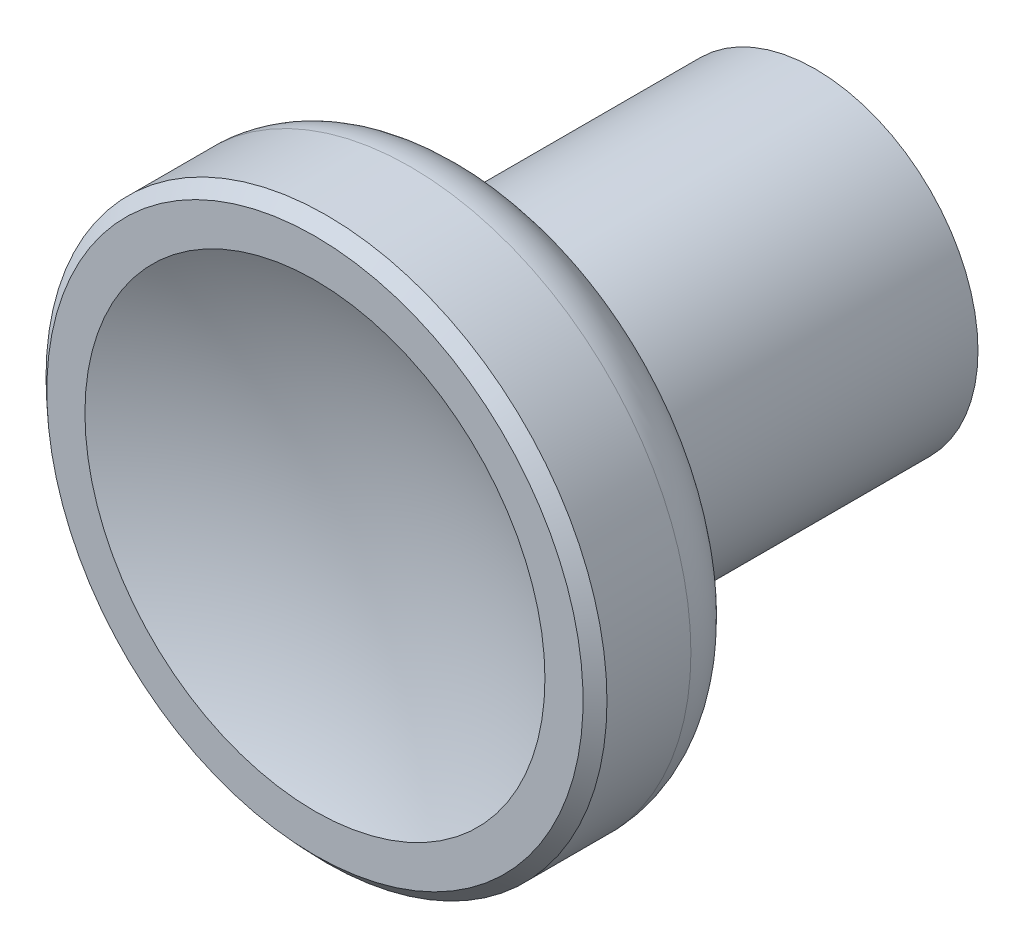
ISO-10303-21;
HEADER;
FILE_DESCRIPTION(('STEP AP214'),'2;1');
FILE_NAME('part.step','',(''),(''),'','','');
FILE_SCHEMA(('AUTOMOTIVE_DESIGN { 1 0 10303 214 1 1 1 1 }'));
ENDSEC;
DATA;
#1=APPLICATION_CONTEXT('core data for automotive mechanical design processes');
#2=APPLICATION_PROTOCOL_DEFINITION('international standard','automotive_design',2000,#1);
#3=PRODUCT_CONTEXT('',#1,'mechanical');
#4=PRODUCT('Part','Part','',(#3));
#5=PRODUCT_RELATED_PRODUCT_CATEGORY('part','',(#4));
#6=PRODUCT_DEFINITION_FORMATION('','',#4);
#7=PRODUCT_DEFINITION_CONTEXT('part definition',#1,'design');
#8=PRODUCT_DEFINITION('design','',#6,#7);
#9=PRODUCT_DEFINITION_SHAPE('','',#8);
#10=(LENGTH_UNIT() NAMED_UNIT(*) SI_UNIT(.MILLI.,.METRE.));
#11=(NAMED_UNIT(*) PLANE_ANGLE_UNIT() SI_UNIT($,.RADIAN.));
#12=(NAMED_UNIT(*) SI_UNIT($,.STERADIAN.) SOLID_ANGLE_UNIT());
#13=UNCERTAINTY_MEASURE_WITH_UNIT(LENGTH_MEASURE(1.E-05),#10,'distance_accuracy_value','');
#14=(GEOMETRIC_REPRESENTATION_CONTEXT(3) GLOBAL_UNCERTAINTY_ASSIGNED_CONTEXT((#13)) GLOBAL_UNIT_ASSIGNED_CONTEXT((#10,
#11,#12)) REPRESENTATION_CONTEXT('',''));
#15=CARTESIAN_POINT('',(0.,0.,0.));
#16=DIRECTION('',(0.,0.,1.));
#17=DIRECTION('',(1.,0.,0.));
#18=AXIS2_PLACEMENT_3D('',#15,#16,#17);
#19=CARTESIAN_POINT('',(0.,0.,43.6847281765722));
#20=DIRECTION('',(0.,-1.,0.));
#21=DIRECTION('',(1.,0.,0.));
#22=AXIS2_PLACEMENT_3D('',#19,#20,#21);
#23=SPHERICAL_SURFACE('',#22,23.5343096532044);
#24=CARTESIAN_POINT('',(0.,0.,43.6847281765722));
#25=DIRECTION('',(0.,0.,-1.));
#26=DIRECTION('',(0.,1.,0.));
#27=AXIS2_PLACEMENT_3D('',#24,#25,#26);
#28=SPHERICAL_SURFACE('',#27,23.5343096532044);
#29=CARTESIAN_POINT('',(0.,0.,22.5000178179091));
#30=DIRECTION('',(0.,0.,-1.));
#31=DIRECTION('',(0.,1.,0.));
#32=AXIS2_PLACEMENT_3D('',#29,#30,#31);
#33=CIRCLE('',#32,10.2504525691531);
#34=CARTESIAN_POINT('',(0.,10.2504525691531,22.5000178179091));
#35=VERTEX_POINT('',#34);
#36=EDGE_CURVE('E52',#35,#35,#33,.T.);
#37=ORIENTED_EDGE('',*,*,#36,.F.);
#38=EDGE_LOOP('',(#37));
#39=FACE_BOUND('',#38,.T.);
#40=ADVANCED_FACE('F12',(#39),#28,.F.);
#41=CARTESIAN_POINT('',(4.,0.,12.));
#42=DIRECTION('',(0.,0.,1.));
#43=DIRECTION('',(0.,-1.,0.));
#44=AXIS2_PLACEMENT_3D('',#41,#42,#43);
#45=PLANE('',#44);
#46=CARTESIAN_POINT('',(0.,0.,12.));
#47=DIRECTION('',(0.,0.,-1.));
#48=DIRECTION('',(0.,1.,0.));
#49=AXIS2_PLACEMENT_3D('',#46,#47,#48);
#50=CIRCLE('',#49,4.);
#51=CARTESIAN_POINT('',(0.,4.,12.));
#52=VERTEX_POINT('',#51);
#53=EDGE_CURVE('E8',#52,#52,#50,.T.);
#54=ORIENTED_EDGE('',*,*,#53,.T.);
#55=EDGE_LOOP('',(#54));
#56=FACE_BOUND('',#55,.T.);
#57=ADVANCED_FACE('F59',(#56),#45,.F.);
#58=CARTESIAN_POINT('',(0.,0.,-2.38339822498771));
#59=DIRECTION('',(0.,0.,-1.));
#60=DIRECTION('',(0.,1.,0.));
#61=AXIS2_PLACEMENT_3D('',#58,#59,#60);
#62=CYLINDRICAL_SURFACE('',#61,4.);
#63=CARTESIAN_POINT('',(0.,0.,0.));
#64=DIRECTION('',(0.,0.,-1.));
#65=DIRECTION('',(0.,1.,0.));
#66=AXIS2_PLACEMENT_3D('',#63,#64,#65);
#67=CIRCLE('',#66,4.);
#68=CARTESIAN_POINT('',(0.,4.,0.));
#69=VERTEX_POINT('',#68);
#70=EDGE_CURVE('E18',#69,#69,#67,.T.);
#71=ORIENTED_EDGE('',*,*,#70,.T.);
#72=EDGE_LOOP('',(#71));
#73=FACE_BOUND('',#72,.T.);
#74=ORIENTED_EDGE('',*,*,#53,.F.);
#75=EDGE_LOOP('',(#74));
#76=FACE_BOUND('',#75,.T.);
#77=ADVANCED_FACE('F65',(#73,#76),#62,.F.);
#78=CARTESIAN_POINT('',(4.,0.,0.));
#79=DIRECTION('',(0.,0.,-1.));
#80=DIRECTION('',(0.,1.,0.));
#81=AXIS2_PLACEMENT_3D('',#78,#79,#80);
#82=PLANE('',#81);
#83=CARTESIAN_POINT('',(0.,0.,0.));
#84=DIRECTION('',(0.,0.,-1.));
#85=DIRECTION('',(0.,1.,0.));
#86=AXIS2_PLACEMENT_3D('',#83,#84,#85);
#87=CIRCLE('',#86,5.);
#88=CARTESIAN_POINT('',(0.,5.,0.));
#89=VERTEX_POINT('',#88);
#90=EDGE_CURVE('E22',#89,#89,#87,.T.);
#91=ORIENTED_EDGE('',*,*,#90,.T.);
#92=EDGE_LOOP('',(#91));
#93=FACE_BOUND('',#92,.T.);
#94=ORIENTED_EDGE('',*,*,#70,.F.);
#95=EDGE_LOOP('',(#94));
#96=FACE_BOUND('',#95,.T.);
#97=ADVANCED_FACE('F70',(#93,#96),#82,.T.);
#98=CARTESIAN_POINT('',(0.,0.,-2.38339822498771));
#99=DIRECTION('',(0.,0.,-1.));
#100=DIRECTION('',(0.,1.,0.));
#101=AXIS2_PLACEMENT_3D('',#98,#99,#100);
#102=CYLINDRICAL_SURFACE('',#101,5.);
#103=ORIENTED_EDGE('',*,*,#90,.F.);
#104=EDGE_LOOP('',(#103));
#105=FACE_BOUND('',#104,.T.);
#106=CARTESIAN_POINT('',(0.,0.,0.200000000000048));
#107=DIRECTION('',(0.,0.,-1.));
#108=DIRECTION('',(0.,1.,0.));
#109=AXIS2_PLACEMENT_3D('',#106,#107,#108);
#110=CIRCLE('',#109,5.);
#111=CARTESIAN_POINT('',(0.,5.,0.200000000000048));
#112=VERTEX_POINT('',#111);
#113=EDGE_CURVE('E26',#112,#112,#110,.T.);
#114=ORIENTED_EDGE('',*,*,#113,.T.);
#115=EDGE_LOOP('',(#114));
#116=FACE_BOUND('',#115,.T.);
#117=ADVANCED_FACE('F75',(#105,#116),#102,.T.);
#118=CARTESIAN_POINT('',(5.0000000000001,0.,0.200000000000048));
#119=DIRECTION('',(0.,0.,-1.));
#120=DIRECTION('',(0.,1.,0.));
#121=AXIS2_PLACEMENT_3D('',#118,#119,#120);
#122=PLANE('',#121);
#123=CARTESIAN_POINT('',(0.,0.,0.200000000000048));
#124=DIRECTION('',(0.,0.,-1.));
#125=DIRECTION('',(0.,1.,0.));
#126=AXIS2_PLACEMENT_3D('',#123,#124,#125);
#127=CIRCLE('',#126,7.25);
#128=CARTESIAN_POINT('',(0.,7.25,0.200000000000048));
#129=VERTEX_POINT('',#128);
#130=EDGE_CURVE('E31',#129,#129,#127,.T.);
#131=ORIENTED_EDGE('',*,*,#130,.T.);
#132=EDGE_LOOP('',(#131));
#133=FACE_BOUND('',#132,.T.);
#134=ORIENTED_EDGE('',*,*,#113,.F.);
#135=EDGE_LOOP('',(#134));
#136=FACE_BOUND('',#135,.T.);
#137=ADVANCED_FACE('F79',(#133,#136),#122,.T.);
#138=CARTESIAN_POINT('',(0.,0.,-2.38339822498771));
#139=DIRECTION('',(0.,0.,-1.));
#140=DIRECTION('',(0.,1.,0.));
#141=AXIS2_PLACEMENT_3D('',#138,#139,#140);
#142=CYLINDRICAL_SURFACE('',#141,7.25);
#143=CARTESIAN_POINT('',(0.,0.,14.));
#144=DIRECTION('',(0.,0.,-1.));
#145=DIRECTION('',(0.,1.,0.));
#146=AXIS2_PLACEMENT_3D('',#143,#144,#145);
#147=CIRCLE('',#146,7.25);
#148=CARTESIAN_POINT('',(0.,7.25,14.));
#149=VERTEX_POINT('',#148);
#150=EDGE_CURVE('E34',#149,#149,#147,.T.);
#151=ORIENTED_EDGE('',*,*,#150,.T.);
#152=EDGE_LOOP('',(#151));
#153=FACE_BOUND('',#152,.T.);
#154=ORIENTED_EDGE('',*,*,#130,.F.);
#155=EDGE_LOOP('',(#154));
#156=FACE_BOUND('',#155,.T.);
#157=ADVANCED_FACE('F83',(#153,#156),#142,.T.);
#158=CARTESIAN_POINT('',(0.,0.,14.));
#159=DIRECTION('',(0.,0.,-1.));
#160=DIRECTION('',(0.,1.,0.));
#161=AXIS2_PLACEMENT_3D('',#158,#159,#160);
#162=TOROIDAL_SURFACE('',#161,7.75,0.5);
#163=ORIENTED_EDGE('',*,*,#150,.F.);
#164=EDGE_LOOP('',(#163));
#165=FACE_BOUND('',#164,.T.);
#166=CARTESIAN_POINT('',(0.,0.,14.4670163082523));
#167=DIRECTION('',(0.,0.,-1.));
#168=DIRECTION('',(0.,1.,0.));
#169=AXIS2_PLACEMENT_3D('',#166,#167,#168);
#170=CIRCLE('',#169,7.57140613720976);
#171=CARTESIAN_POINT('',(0.,7.57140613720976,14.4670163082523));
#172=VERTEX_POINT('',#171);
#173=EDGE_CURVE('E37',#172,#172,#170,.T.);
#174=ORIENTED_EDGE('',*,*,#173,.T.);
#175=EDGE_LOOP('',(#174));
#176=FACE_BOUND('',#175,.T.);
#177=ADVANCED_FACE('F87',(#165,#176),#162,.F.);
#178=CARTESIAN_POINT('',(0.,0.,14.4670163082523));
#179=DIRECTION('',(0.,0.,1.));
#180=DIRECTION('',(0.,-1.,0.));
#181=AXIS2_PLACEMENT_3D('',#178,#179,#180);
#182=CONICAL_SURFACE('',#181,7.57140613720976,1.20554106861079);
#183=CARTESIAN_POINT('',(0.,0.,15.675774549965));
#184=DIRECTION('',(0.,0.,-1.));
#185=DIRECTION('',(0.,1.,0.));
#186=AXIS2_PLACEMENT_3D('',#183,#184,#185);
#187=CIRCLE('',#186,10.7322639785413);
#188=CARTESIAN_POINT('',(0.,10.7322639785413,15.675774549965));
#189=VERTEX_POINT('',#188);
#190=EDGE_CURVE('E40',#189,#189,#187,.T.);
#191=ORIENTED_EDGE('',*,*,#190,.T.);
#192=EDGE_LOOP('',(#191));
#193=FACE_BOUND('',#192,.T.);
#194=ORIENTED_EDGE('',*,*,#173,.F.);
#195=EDGE_LOOP('',(#194));
#196=FACE_BOUND('',#195,.T.);
#197=ADVANCED_FACE('F91',(#193,#196),#182,.T.);
#198=CARTESIAN_POINT('',(0.,0.,18.2443675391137));
#199=DIRECTION('',(0.,0.,-1.));
#200=DIRECTION('',(0.,1.,0.));
#201=AXIS2_PLACEMENT_3D('',#198,#199,#200);
#202=TOROIDAL_SURFACE('',#201,9.74999647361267,2.75000352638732);
#203=CARTESIAN_POINT('',(0.,0.,18.2443675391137));
#204=DIRECTION('',(0.,0.,-1.));
#205=DIRECTION('',(0.,1.,0.));
#206=AXIS2_PLACEMENT_3D('',#203,#204,#205);
#207=CIRCLE('',#206,12.5);
#208=CARTESIAN_POINT('',(0.,12.5,18.2443675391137));
#209=VERTEX_POINT('',#208);
#210=EDGE_CURVE('E43',#209,#209,#207,.T.);
#211=ORIENTED_EDGE('',*,*,#210,.T.);
#212=EDGE_LOOP('',(#211));
#213=FACE_BOUND('',#212,.T.);
#214=ORIENTED_EDGE('',*,*,#190,.F.);
#215=EDGE_LOOP('',(#214));
#216=FACE_BOUND('',#215,.T.);
#217=ADVANCED_FACE('F95',(#213,#216),#202,.T.);
#218=CARTESIAN_POINT('',(0.,0.,-2.38339822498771));
#219=DIRECTION('',(0.,0.,-1.));
#220=DIRECTION('',(0.,1.,0.));
#221=AXIS2_PLACEMENT_3D('',#218,#219,#220);
#222=CYLINDRICAL_SURFACE('',#221,12.5);
#223=ORIENTED_EDGE('',*,*,#210,.F.);
#224=EDGE_LOOP('',(#223));
#225=FACE_BOUND('',#224,.T.);
#226=CARTESIAN_POINT('',(0.,0.,21.984871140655));
#227=DIRECTION('',(0.,0.,-1.));
#228=DIRECTION('',(0.,1.,0.));
#229=AXIS2_PLACEMENT_3D('',#226,#227,#228);
#230=CIRCLE('',#229,12.5);
#231=CARTESIAN_POINT('',(0.,12.5,21.984871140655));
#232=VERTEX_POINT('',#231);
#233=EDGE_CURVE('E46',#232,#232,#230,.T.);
#234=ORIENTED_EDGE('',*,*,#233,.T.);
#235=EDGE_LOOP('',(#234));
#236=FACE_BOUND('',#235,.T.);
#237=ADVANCED_FACE('F99',(#225,#236),#222,.T.);
#238=CARTESIAN_POINT('',(0.,0.,22.500022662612));
#239=DIRECTION('',(0.,0.,-1.));
#240=DIRECTION('',(0.,1.,0.));
#241=AXIS2_PLACEMENT_3D('',#238,#239,#240);
#242=CONICAL_SURFACE('',#241,11.9499640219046,0.818136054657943);
#243=ORIENTED_EDGE('',*,*,#233,.F.);
#244=EDGE_LOOP('',(#243));
#245=FACE_BOUND('',#244,.T.);
#246=CARTESIAN_POINT('',(0.,0.,22.500022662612));
#247=DIRECTION('',(0.,0.,-1.));
#248=DIRECTION('',(0.,1.,0.));
#249=AXIS2_PLACEMENT_3D('',#246,#247,#248);
#250=CIRCLE('',#249,11.9499640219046);
#251=CARTESIAN_POINT('',(0.,11.9499640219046,22.500022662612));
#252=VERTEX_POINT('',#251);
#253=EDGE_CURVE('E49',#252,#252,#250,.T.);
#254=ORIENTED_EDGE('',*,*,#253,.T.);
#255=EDGE_LOOP('',(#254));
#256=FACE_BOUND('',#255,.T.);
#257=ADVANCED_FACE('F103',(#245,#256),#242,.T.);
#258=CARTESIAN_POINT('',(10.2504525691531,0.,22.5000178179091));
#259=DIRECTION('',(0.,0.,-1.));
#260=DIRECTION('',(0.,1.,0.));
#261=AXIS2_PLACEMENT_3D('',#258,#259,#260);
#262=PLANE('',#261);
#263=ORIENTED_EDGE('',*,*,#253,.F.);
#264=EDGE_LOOP('',(#263));
#265=FACE_BOUND('',#264,.T.);
#266=ORIENTED_EDGE('',*,*,#36,.T.);
#267=EDGE_LOOP('',(#266));
#268=FACE_BOUND('',#267,.T.);
#269=ADVANCED_FACE('F56',(#265,#268),#262,.F.);
#270=CLOSED_SHELL('',(#40,#57,#77,#97,#117,#137,#157,#177,#197,#217,#237,#257,#269));
#271=MANIFOLD_SOLID_BREP('B1',#270);
#272=ADVANCED_BREP_SHAPE_REPRESENTATION('',(#18,#271),#14);
#273=SHAPE_DEFINITION_REPRESENTATION(#9,#272);
ENDSEC;
END-ISO-10303-21;
